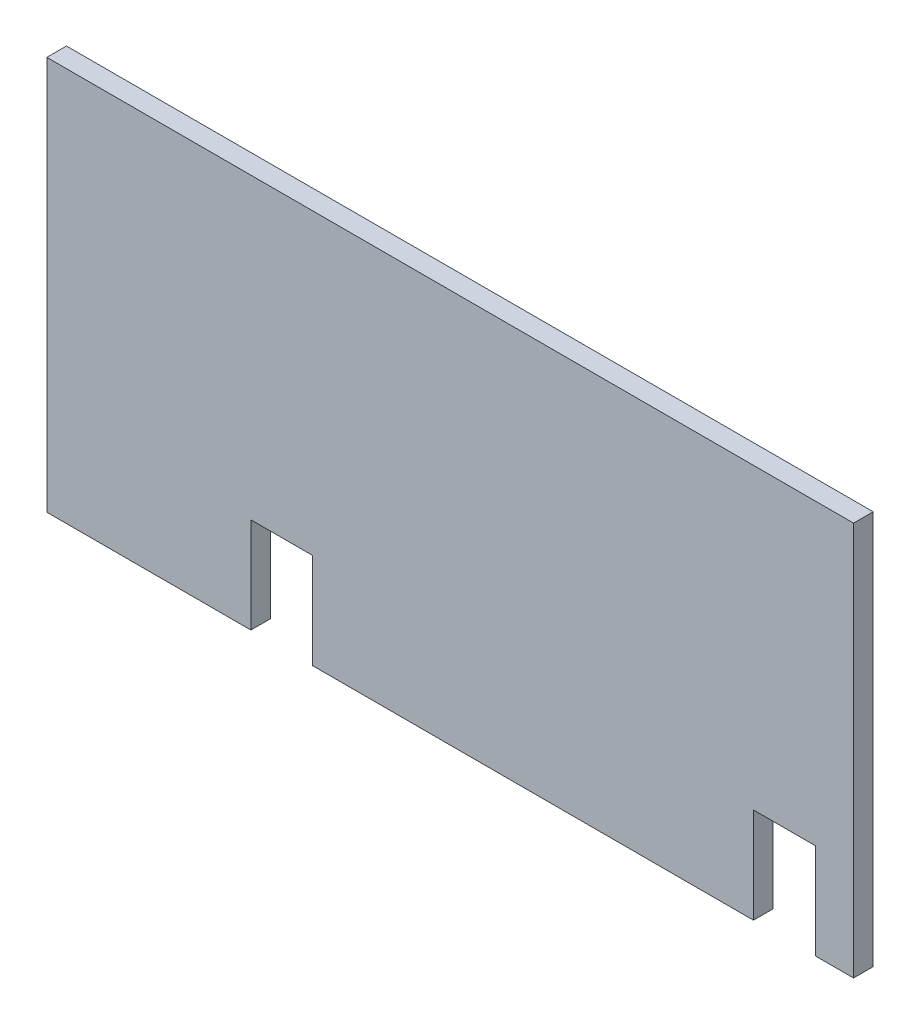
from build123d import *

# Parameters (mm, degrees)
BOSS_EXTRUDE1_DEPTH = 2.54


with BuildPart() as part:
    # Sketch1 → Boss-Extrude1 (new body)
    with BuildSketch(Plane.XY):
        Polygon((-120.396, -17.425), (-94.000001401, -17.425), (-94.000001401, -5.08), (-86.000001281, -5.08), (-86.000001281, -17.425), (-29.000000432, -17.425), (-29.000000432, -5.08), (-21.000000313, -5.08), (-21.000000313, -17.425), (-16.049999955, -17.425), (-16.049999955, 33.528), (-120.396, 33.528), align=None)
    extrude(amount=BOSS_EXTRUDE1_DEPTH)


solid = part.part
